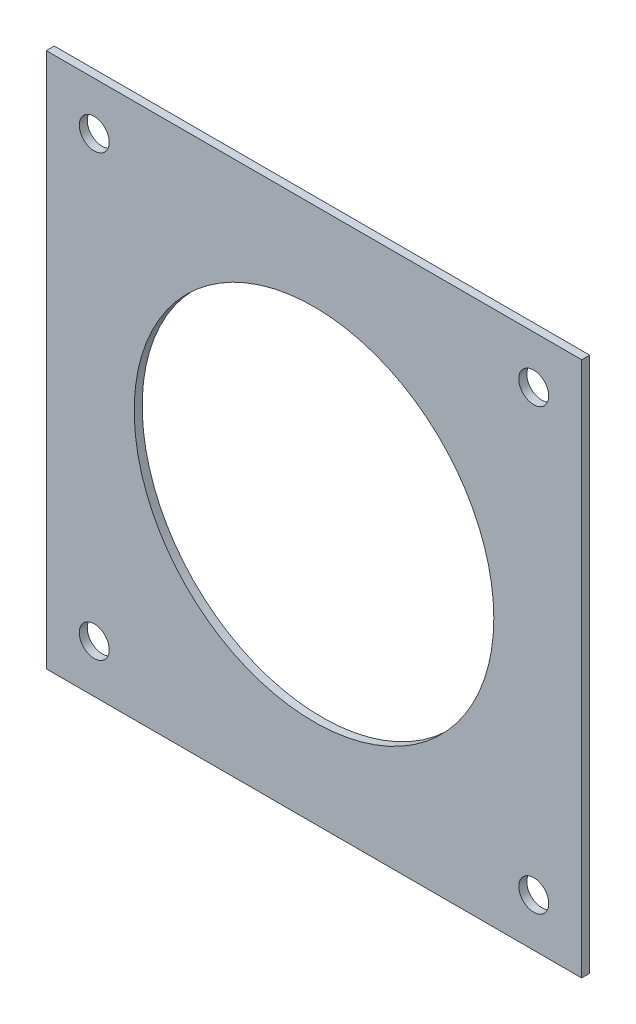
ISO-10303-21;
HEADER;
FILE_DESCRIPTION(('STEP AP214'),'2;1');
FILE_NAME('part.step','',(''),(''),'','','');
FILE_SCHEMA(('AUTOMOTIVE_DESIGN { 1 0 10303 214 1 1 1 1 }'));
ENDSEC;
DATA;
#1=APPLICATION_CONTEXT('core data for automotive mechanical design processes');
#2=APPLICATION_PROTOCOL_DEFINITION('international standard','automotive_design',2000,#1);
#3=PRODUCT_CONTEXT('',#1,'mechanical');
#4=PRODUCT('Part','Part','',(#3));
#5=PRODUCT_RELATED_PRODUCT_CATEGORY('part','',(#4));
#6=PRODUCT_DEFINITION_FORMATION('','',#4);
#7=PRODUCT_DEFINITION_CONTEXT('part definition',#1,'design');
#8=PRODUCT_DEFINITION('design','',#6,#7);
#9=PRODUCT_DEFINITION_SHAPE('','',#8);
#10=(LENGTH_UNIT() NAMED_UNIT(*) SI_UNIT(.MILLI.,.METRE.));
#11=(NAMED_UNIT(*) PLANE_ANGLE_UNIT() SI_UNIT($,.RADIAN.));
#12=(NAMED_UNIT(*) SI_UNIT($,.STERADIAN.) SOLID_ANGLE_UNIT());
#13=UNCERTAINTY_MEASURE_WITH_UNIT(LENGTH_MEASURE(1.E-05),#10,'distance_accuracy_value','');
#14=(GEOMETRIC_REPRESENTATION_CONTEXT(3) GLOBAL_UNCERTAINTY_ASSIGNED_CONTEXT((#13)) GLOBAL_UNIT_ASSIGNED_CONTEXT((#10,
#11,#12)) REPRESENTATION_CONTEXT('',''));
#15=CARTESIAN_POINT('',(0.,0.,0.));
#16=DIRECTION('',(0.,0.,1.));
#17=DIRECTION('',(1.,0.,0.));
#18=AXIS2_PLACEMENT_3D('',#15,#16,#17);
#19=CARTESIAN_POINT('',(-26.8,26.8,0.8));
#20=DIRECTION('',(1.,0.,0.));
#21=DIRECTION('',(0.,1.,0.));
#22=AXIS2_PLACEMENT_3D('',#19,#20,#21);
#23=PLANE('',#22);
#24=DIRECTION('',(0.,-1.,0.));
#25=VECTOR('',#24,1.);
#26=CARTESIAN_POINT('',(-26.8,26.8,0.));
#27=LINE('',#26,#25);
#28=CARTESIAN_POINT('',(-26.8,26.8,0.));
#29=VERTEX_POINT('',#28);
#30=CARTESIAN_POINT('',(-26.8,-26.8,0.));
#31=VERTEX_POINT('',#30);
#32=EDGE_CURVE('E81',#29,#31,#27,.T.);
#33=ORIENTED_EDGE('',*,*,#32,.T.);
#34=DIRECTION('',(0.,0.,-1.));
#35=VECTOR('',#34,1.);
#36=CARTESIAN_POINT('',(-26.8,-26.8,0.8));
#37=LINE('',#36,#35);
#38=CARTESIAN_POINT('',(-26.8,-26.8,0.8));
#39=VERTEX_POINT('',#38);
#40=EDGE_CURVE('E10',#39,#31,#37,.T.);
#41=ORIENTED_EDGE('',*,*,#40,.F.);
#42=DIRECTION('',(0.,-1.,0.));
#43=VECTOR('',#42,1.);
#44=CARTESIAN_POINT('',(-26.8,26.8,0.8));
#45=LINE('',#44,#43);
#46=CARTESIAN_POINT('',(-26.8,26.8,0.8));
#47=VERTEX_POINT('',#46);
#48=EDGE_CURVE('E68',#47,#39,#45,.T.);
#49=ORIENTED_EDGE('',*,*,#48,.F.);
#50=DIRECTION('',(0.,0.,-1.));
#51=VECTOR('',#50,1.);
#52=CARTESIAN_POINT('',(-26.8,26.8,0.8));
#53=LINE('',#52,#51);
#54=EDGE_CURVE('E77',#47,#29,#53,.T.);
#55=ORIENTED_EDGE('',*,*,#54,.T.);
#56=EDGE_LOOP('',(#33,#41,#49,#55));
#57=FACE_BOUND('',#56,.T.);
#58=ADVANCED_FACE('F15',(#57),#23,.F.);
#59=CARTESIAN_POINT('',(-26.8,-26.8,0.8));
#60=DIRECTION('',(0.,1.,0.));
#61=DIRECTION('',(0.,0.,1.));
#62=AXIS2_PLACEMENT_3D('',#59,#60,#61);
#63=PLANE('',#62);
#64=DIRECTION('',(1.,0.,0.));
#65=VECTOR('',#64,1.);
#66=CARTESIAN_POINT('',(-26.8,-26.8,0.));
#67=LINE('',#66,#65);
#68=CARTESIAN_POINT('',(26.8,-26.8,0.));
#69=VERTEX_POINT('',#68);
#70=EDGE_CURVE('E72',#31,#69,#67,.T.);
#71=ORIENTED_EDGE('',*,*,#70,.T.);
#72=DIRECTION('',(0.,0.,-1.));
#73=VECTOR('',#72,1.);
#74=CARTESIAN_POINT('',(26.8,-26.8,0.8));
#75=LINE('',#74,#73);
#76=CARTESIAN_POINT('',(26.8,-26.8,0.8));
#77=VERTEX_POINT('',#76);
#78=EDGE_CURVE('E24',#77,#69,#75,.T.);
#79=ORIENTED_EDGE('',*,*,#78,.F.);
#80=DIRECTION('',(1.,0.,0.));
#81=VECTOR('',#80,1.);
#82=CARTESIAN_POINT('',(-26.8,-26.8,0.8));
#83=LINE('',#82,#81);
#84=EDGE_CURVE('E63',#39,#77,#83,.T.);
#85=ORIENTED_EDGE('',*,*,#84,.F.);
#86=ORIENTED_EDGE('',*,*,#40,.T.);
#87=EDGE_LOOP('',(#71,#79,#85,#86));
#88=FACE_BOUND('',#87,.T.);
#89=ADVANCED_FACE('F71',(#88),#63,.F.);
#90=CARTESIAN_POINT('',(26.8,26.8,0.8));
#91=DIRECTION('',(-1.,0.,0.));
#92=DIRECTION('',(0.,-1.,0.));
#93=AXIS2_PLACEMENT_3D('',#90,#91,#92);
#94=PLANE('',#93);
#95=DIRECTION('',(0.,1.,0.));
#96=VECTOR('',#95,1.);
#97=CARTESIAN_POINT('',(26.8,26.8,0.));
#98=LINE('',#97,#96);
#99=CARTESIAN_POINT('',(26.8,26.8,0.));
#100=VERTEX_POINT('',#99);
#101=EDGE_CURVE('E50',#69,#100,#98,.T.);
#102=ORIENTED_EDGE('',*,*,#101,.T.);
#103=DIRECTION('',(0.,0.,-1.));
#104=VECTOR('',#103,1.);
#105=CARTESIAN_POINT('',(26.8,26.8,0.8));
#106=LINE('',#105,#104);
#107=CARTESIAN_POINT('',(26.8,26.8,0.8));
#108=VERTEX_POINT('',#107);
#109=EDGE_CURVE('E73',#108,#100,#106,.T.);
#110=ORIENTED_EDGE('',*,*,#109,.F.);
#111=DIRECTION('',(0.,1.,0.));
#112=VECTOR('',#111,1.);
#113=CARTESIAN_POINT('',(26.8,26.8,0.8));
#114=LINE('',#113,#112);
#115=EDGE_CURVE('E66',#77,#108,#114,.T.);
#116=ORIENTED_EDGE('',*,*,#115,.F.);
#117=ORIENTED_EDGE('',*,*,#78,.T.);
#118=EDGE_LOOP('',(#102,#110,#116,#117));
#119=FACE_BOUND('',#118,.T.);
#120=ADVANCED_FACE('F75',(#119),#94,.F.);
#121=CARTESIAN_POINT('',(-26.8,26.8,0.8));
#122=DIRECTION('',(0.,-1.,0.));
#123=DIRECTION('',(0.,0.,-1.));
#124=AXIS2_PLACEMENT_3D('',#121,#122,#123);
#125=PLANE('',#124);
#126=DIRECTION('',(-1.,0.,0.));
#127=VECTOR('',#126,1.);
#128=CARTESIAN_POINT('',(-26.8,26.8,0.));
#129=LINE('',#128,#127);
#130=EDGE_CURVE('E56',#100,#29,#129,.T.);
#131=ORIENTED_EDGE('',*,*,#130,.T.);
#132=ORIENTED_EDGE('',*,*,#54,.F.);
#133=DIRECTION('',(-1.,0.,0.));
#134=VECTOR('',#133,1.);
#135=CARTESIAN_POINT('',(-26.8,26.8,0.8));
#136=LINE('',#135,#134);
#137=EDGE_CURVE('E33',#108,#47,#136,.T.);
#138=ORIENTED_EDGE('',*,*,#137,.F.);
#139=ORIENTED_EDGE('',*,*,#109,.T.);
#140=EDGE_LOOP('',(#131,#132,#138,#139));
#141=FACE_BOUND('',#140,.T.);
#142=ADVANCED_FACE('F120',(#141),#125,.F.);
#143=CARTESIAN_POINT('',(-26.8,-26.8,0.8));
#144=DIRECTION('',(0.,0.,1.));
#145=DIRECTION('',(1.,0.,0.));
#146=AXIS2_PLACEMENT_3D('',#143,#144,#145);
#147=PLANE('',#146);
#148=CARTESIAN_POINT('',(0.,0.,0.8));
#149=DIRECTION('',(0.,0.,1.));
#150=DIRECTION('',(1.,0.,0.));
#151=AXIS2_PLACEMENT_3D('',#148,#149,#150);
#152=CIRCLE('',#151,18.);
#153=CARTESIAN_POINT('',(18.,0.,0.8));
#154=VERTEX_POINT('',#153);
#155=EDGE_CURVE('E338',#154,#154,#152,.T.);
#156=ORIENTED_EDGE('',*,*,#155,.F.);
#157=EDGE_LOOP('',(#156));
#158=FACE_BOUND('',#157,.T.);
#159=CARTESIAN_POINT('',(-22.,-22.,0.8));
#160=DIRECTION('',(0.,0.,1.));
#161=DIRECTION('',(-1.,0.,0.));
#162=AXIS2_PLACEMENT_3D('',#159,#160,#161);
#163=CIRCLE('',#162,1.5);
#164=CARTESIAN_POINT('',(-23.5,-22.,0.8));
#165=VERTEX_POINT('',#164);
#166=EDGE_CURVE('E108',#165,#165,#163,.T.);
#167=ORIENTED_EDGE('',*,*,#166,.F.);
#168=EDGE_LOOP('',(#167));
#169=FACE_BOUND('',#168,.T.);
#170=CARTESIAN_POINT('',(22.,-22.,0.8));
#171=DIRECTION('',(0.,0.,1.));
#172=DIRECTION('',(1.,0.,0.));
#173=AXIS2_PLACEMENT_3D('',#170,#171,#172);
#174=CIRCLE('',#173,1.5);
#175=CARTESIAN_POINT('',(23.5,-22.,0.8));
#176=VERTEX_POINT('',#175);
#177=EDGE_CURVE('E98',#176,#176,#174,.T.);
#178=ORIENTED_EDGE('',*,*,#177,.F.);
#179=EDGE_LOOP('',(#178));
#180=FACE_BOUND('',#179,.T.);
#181=CARTESIAN_POINT('',(22.,22.,0.8));
#182=DIRECTION('',(0.,0.,1.));
#183=DIRECTION('',(-1.,0.,0.));
#184=AXIS2_PLACEMENT_3D('',#181,#182,#183);
#185=CIRCLE('',#184,1.5);
#186=CARTESIAN_POINT('',(20.5,22.,0.8));
#187=VERTEX_POINT('',#186);
#188=EDGE_CURVE('E95',#187,#187,#185,.T.);
#189=ORIENTED_EDGE('',*,*,#188,.F.);
#190=EDGE_LOOP('',(#189));
#191=FACE_BOUND('',#190,.T.);
#192=CARTESIAN_POINT('',(-22.,22.,0.8));
#193=DIRECTION('',(0.,0.,1.));
#194=DIRECTION('',(1.,0.,0.));
#195=AXIS2_PLACEMENT_3D('',#192,#193,#194);
#196=CIRCLE('',#195,1.5);
#197=CARTESIAN_POINT('',(-20.5,22.,0.8));
#198=VERTEX_POINT('',#197);
#199=EDGE_CURVE('E92',#198,#198,#196,.T.);
#200=ORIENTED_EDGE('',*,*,#199,.F.);
#201=EDGE_LOOP('',(#200));
#202=FACE_BOUND('',#201,.T.);
#203=ORIENTED_EDGE('',*,*,#48,.T.);
#204=ORIENTED_EDGE('',*,*,#84,.T.);
#205=ORIENTED_EDGE('',*,*,#115,.T.);
#206=ORIENTED_EDGE('',*,*,#137,.T.);
#207=EDGE_LOOP('',(#203,#204,#205,#206));
#208=FACE_BOUND('',#207,.T.);
#209=ADVANCED_FACE('F64',(#158,#169,#180,#191,#202,#208),#147,.T.);
#210=CARTESIAN_POINT('',(-26.8,-26.8,0.));
#211=DIRECTION('',(0.,0.,1.));
#212=DIRECTION('',(1.,0.,0.));
#213=AXIS2_PLACEMENT_3D('',#210,#211,#212);
#214=PLANE('',#213);
#215=CARTESIAN_POINT('',(0.,0.,0.));
#216=DIRECTION('',(0.,0.,1.));
#217=DIRECTION('',(1.,0.,0.));
#218=AXIS2_PLACEMENT_3D('',#215,#216,#217);
#219=CIRCLE('',#218,18.);
#220=CARTESIAN_POINT('',(18.,0.,0.));
#221=VERTEX_POINT('',#220);
#222=EDGE_CURVE('E341',#221,#221,#219,.F.);
#223=ORIENTED_EDGE('',*,*,#222,.F.);
#224=EDGE_LOOP('',(#223));
#225=FACE_BOUND('',#224,.T.);
#226=CARTESIAN_POINT('',(-22.,-22.,0.));
#227=DIRECTION('',(0.,0.,1.));
#228=DIRECTION('',(1.,0.,0.));
#229=AXIS2_PLACEMENT_3D('',#226,#227,#228);
#230=CIRCLE('',#229,1.5);
#231=CARTESIAN_POINT('',(-20.5,-22.,0.));
#232=VERTEX_POINT('',#231);
#233=EDGE_CURVE('E18',#232,#232,#230,.T.);
#234=ORIENTED_EDGE('',*,*,#233,.T.);
#235=EDGE_LOOP('',(#234));
#236=FACE_BOUND('',#235,.T.);
#237=CARTESIAN_POINT('',(22.,-22.,0.));
#238=DIRECTION('',(0.,0.,1.));
#239=DIRECTION('',(1.,0.,0.));
#240=AXIS2_PLACEMENT_3D('',#237,#238,#239);
#241=CIRCLE('',#240,1.5);
#242=CARTESIAN_POINT('',(23.5,-22.,0.));
#243=VERTEX_POINT('',#242);
#244=EDGE_CURVE('E96',#243,#243,#241,.T.);
#245=ORIENTED_EDGE('',*,*,#244,.T.);
#246=EDGE_LOOP('',(#245));
#247=FACE_BOUND('',#246,.T.);
#248=CARTESIAN_POINT('',(22.,22.,0.));
#249=DIRECTION('',(0.,0.,1.));
#250=DIRECTION('',(1.,0.,0.));
#251=AXIS2_PLACEMENT_3D('',#248,#249,#250);
#252=CIRCLE('',#251,1.5);
#253=CARTESIAN_POINT('',(23.5,22.,0.));
#254=VERTEX_POINT('',#253);
#255=EDGE_CURVE('E93',#254,#254,#252,.T.);
#256=ORIENTED_EDGE('',*,*,#255,.T.);
#257=EDGE_LOOP('',(#256));
#258=FACE_BOUND('',#257,.T.);
#259=CARTESIAN_POINT('',(-22.,22.,0.));
#260=DIRECTION('',(0.,0.,1.));
#261=DIRECTION('',(1.,0.,0.));
#262=AXIS2_PLACEMENT_3D('',#259,#260,#261);
#263=CIRCLE('',#262,1.5);
#264=CARTESIAN_POINT('',(-20.5,22.,0.));
#265=VERTEX_POINT('',#264);
#266=EDGE_CURVE('E84',#265,#265,#263,.T.);
#267=ORIENTED_EDGE('',*,*,#266,.T.);
#268=EDGE_LOOP('',(#267));
#269=FACE_BOUND('',#268,.T.);
#270=ORIENTED_EDGE('',*,*,#32,.F.);
#271=ORIENTED_EDGE('',*,*,#130,.F.);
#272=ORIENTED_EDGE('',*,*,#101,.F.);
#273=ORIENTED_EDGE('',*,*,#70,.F.);
#274=EDGE_LOOP('',(#270,#271,#272,#273));
#275=FACE_BOUND('',#274,.T.);
#276=ADVANCED_FACE('F119',(#225,#236,#247,#258,#269,#275),#214,.F.);
#277=CARTESIAN_POINT('',(-22.,22.,-1.2));
#278=DIRECTION('',(0.,0.,1.));
#279=DIRECTION('',(1.,0.,0.));
#280=AXIS2_PLACEMENT_3D('',#277,#278,#279);
#281=CYLINDRICAL_SURFACE('',#280,1.5);
#282=ORIENTED_EDGE('',*,*,#199,.T.);
#283=EDGE_LOOP('',(#282));
#284=FACE_BOUND('',#283,.T.);
#285=ORIENTED_EDGE('',*,*,#266,.F.);
#286=EDGE_LOOP('',(#285));
#287=FACE_BOUND('',#286,.T.);
#288=ADVANCED_FACE('F115',(#284,#287),#281,.F.);
#289=CARTESIAN_POINT('',(22.,22.,-1.2));
#290=DIRECTION('',(0.,0.,1.));
#291=DIRECTION('',(1.,0.,0.));
#292=AXIS2_PLACEMENT_3D('',#289,#290,#291);
#293=CYLINDRICAL_SURFACE('',#292,1.5);
#294=ORIENTED_EDGE('',*,*,#188,.T.);
#295=EDGE_LOOP('',(#294));
#296=FACE_BOUND('',#295,.T.);
#297=ORIENTED_EDGE('',*,*,#255,.F.);
#298=EDGE_LOOP('',(#297));
#299=FACE_BOUND('',#298,.T.);
#300=ADVANCED_FACE('F187',(#296,#299),#293,.F.);
#301=CARTESIAN_POINT('',(22.,-22.,-1.2));
#302=DIRECTION('',(0.,0.,1.));
#303=DIRECTION('',(1.,0.,0.));
#304=AXIS2_PLACEMENT_3D('',#301,#302,#303);
#305=CYLINDRICAL_SURFACE('',#304,1.5);
#306=ORIENTED_EDGE('',*,*,#177,.T.);
#307=EDGE_LOOP('',(#306));
#308=FACE_BOUND('',#307,.T.);
#309=ORIENTED_EDGE('',*,*,#244,.F.);
#310=EDGE_LOOP('',(#309));
#311=FACE_BOUND('',#310,.T.);
#312=ADVANCED_FACE('F198',(#308,#311),#305,.F.);
#313=CARTESIAN_POINT('',(-22.,-22.,-1.2));
#314=DIRECTION('',(0.,0.,1.));
#315=DIRECTION('',(1.,0.,0.));
#316=AXIS2_PLACEMENT_3D('',#313,#314,#315);
#317=CYLINDRICAL_SURFACE('',#316,1.5);
#318=ORIENTED_EDGE('',*,*,#166,.T.);
#319=EDGE_LOOP('',(#318));
#320=FACE_BOUND('',#319,.T.);
#321=ORIENTED_EDGE('',*,*,#233,.F.);
#322=EDGE_LOOP('',(#321));
#323=FACE_BOUND('',#322,.T.);
#324=ADVANCED_FACE('F211',(#320,#323),#317,.F.);
#325=CARTESIAN_POINT('',(0.,0.,-0.00100000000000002));
#326=DIRECTION('',(0.,0.,1.));
#327=DIRECTION('',(1.,0.,0.));
#328=AXIS2_PLACEMENT_3D('',#325,#326,#327);
#329=CYLINDRICAL_SURFACE('',#328,18.);
#330=CARTESIAN_POINT('',(18.,0.,0.8));
#331=CARTESIAN_POINT('',(18.,0.,0.791666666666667));
#332=CARTESIAN_POINT('',(18.,0.,0.783333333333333));
#333=CARTESIAN_POINT('',(18.,0.,0.766666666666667));
#334=CARTESIAN_POINT('',(18.,0.,0.758333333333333));
#335=CARTESIAN_POINT('',(18.,0.,0.741666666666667));
#336=CARTESIAN_POINT('',(18.,0.,0.733333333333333));
#337=CARTESIAN_POINT('',(18.,0.,0.716666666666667));
#338=CARTESIAN_POINT('',(18.,0.,0.708333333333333));
#339=CARTESIAN_POINT('',(18.,0.,0.691666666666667));
#340=CARTESIAN_POINT('',(18.,0.,0.683333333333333));
#341=CARTESIAN_POINT('',(18.,0.,0.666666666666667));
#342=CARTESIAN_POINT('',(18.,0.,0.658333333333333));
#343=CARTESIAN_POINT('',(18.,0.,0.641666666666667));
#344=CARTESIAN_POINT('',(18.,0.,0.633333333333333));
#345=CARTESIAN_POINT('',(18.,0.,0.616666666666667));
#346=CARTESIAN_POINT('',(18.,0.,0.608333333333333));
#347=CARTESIAN_POINT('',(18.,0.,0.591666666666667));
#348=CARTESIAN_POINT('',(18.,0.,0.583333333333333));
#349=CARTESIAN_POINT('',(18.,0.,0.566666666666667));
#350=CARTESIAN_POINT('',(18.,0.,0.558333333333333));
#351=CARTESIAN_POINT('',(18.,0.,0.541666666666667));
#352=CARTESIAN_POINT('',(18.,0.,0.533333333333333));
#353=CARTESIAN_POINT('',(18.,0.,0.516666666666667));
#354=CARTESIAN_POINT('',(18.,0.,0.508333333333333));
#355=CARTESIAN_POINT('',(18.,0.,0.491666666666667));
#356=CARTESIAN_POINT('',(18.,0.,0.483333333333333));
#357=CARTESIAN_POINT('',(18.,0.,0.466666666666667));
#358=CARTESIAN_POINT('',(18.,0.,0.458333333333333));
#359=CARTESIAN_POINT('',(18.,0.,0.441666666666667));
#360=CARTESIAN_POINT('',(18.,0.,0.433333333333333));
#361=CARTESIAN_POINT('',(18.,0.,0.416666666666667));
#362=CARTESIAN_POINT('',(18.,0.,0.408333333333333));
#363=CARTESIAN_POINT('',(18.,0.,0.391666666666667));
#364=CARTESIAN_POINT('',(18.,0.,0.383333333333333));
#365=CARTESIAN_POINT('',(18.,0.,0.366666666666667));
#366=CARTESIAN_POINT('',(18.,0.,0.358333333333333));
#367=CARTESIAN_POINT('',(18.,0.,0.341666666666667));
#368=CARTESIAN_POINT('',(18.,0.,0.333333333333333));
#369=CARTESIAN_POINT('',(18.,0.,0.316666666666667));
#370=CARTESIAN_POINT('',(18.,0.,0.308333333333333));
#371=CARTESIAN_POINT('',(18.,0.,0.291666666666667));
#372=CARTESIAN_POINT('',(18.,0.,0.283333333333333));
#373=CARTESIAN_POINT('',(18.,0.,0.266666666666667));
#374=CARTESIAN_POINT('',(18.,0.,0.258333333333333));
#375=CARTESIAN_POINT('',(18.,0.,0.241666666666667));
#376=CARTESIAN_POINT('',(18.,0.,0.233333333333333));
#377=CARTESIAN_POINT('',(18.,0.,0.216666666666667));
#378=CARTESIAN_POINT('',(18.,0.,0.208333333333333));
#379=CARTESIAN_POINT('',(18.,0.,0.191666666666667));
#380=CARTESIAN_POINT('',(18.,0.,0.183333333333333));
#381=CARTESIAN_POINT('',(18.,0.,0.166666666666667));
#382=CARTESIAN_POINT('',(18.,0.,0.158333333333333));
#383=CARTESIAN_POINT('',(18.,0.,0.141666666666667));
#384=CARTESIAN_POINT('',(18.,0.,0.133333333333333));
#385=CARTESIAN_POINT('',(18.,0.,0.116666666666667));
#386=CARTESIAN_POINT('',(18.,0.,0.108333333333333));
#387=CARTESIAN_POINT('',(18.,0.,0.0916666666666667));
#388=CARTESIAN_POINT('',(18.,0.,0.0833333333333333));
#389=CARTESIAN_POINT('',(18.,0.,0.0666666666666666));
#390=CARTESIAN_POINT('',(18.,0.,0.0583333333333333));
#391=CARTESIAN_POINT('',(18.,0.,0.0416666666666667));
#392=CARTESIAN_POINT('',(18.,0.,0.0333333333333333));
#393=CARTESIAN_POINT('',(18.,0.,0.0166666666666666));
#394=CARTESIAN_POINT('',(18.,0.,0.00833333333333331));
#395=CARTESIAN_POINT('',(18.,0.,0.));
#396=B_SPLINE_CURVE_WITH_KNOTS('',3,(#330,#331,#332,#333,#334,#335,#336,#337,#338,#339,#340,
#341,#342,#343,#344,#345,#346,#347,#348,#349,#350,#351,#352,#353,#354,#355,#356,#357,#358,#359,
#360,#361,#362,#363,#364,#365,#366,#367,#368,#369,#370,#371,#372,#373,#374,#375,#376,#377,#378,
#379,#380,#381,#382,#383,#384,#385,#386,#387,#388,#389,#390,#391,#392,#393,#394,#395),
.UNSPECIFIED.,.F.,.F.,(4,2,2,2,2,2,2,2,2,2,2,2,2,2,2,2,2,2,2,2,2,2,2,2,2,2,2,2,2,2,2,2,4),(0.,
0.025,0.05,0.075,0.1,0.125,0.15,0.175,0.2,0.225,0.25,0.275,0.3,0.325,0.35,0.375,0.4,0.425,0.45,
0.475,0.5,0.525,0.55,0.575,0.6,0.625,0.65,0.675,0.7,0.725,0.75,0.775,0.8),.UNSPECIFIED.);
#397=EDGE_CURVE('BSEAM222',#154,#221,#396,.T.);
#398=ORIENTED_EDGE('',*,*,#155,.T.);
#399=ORIENTED_EDGE('',*,*,#222,.T.);
#400=ORIENTED_EDGE('',*,*,#397,.T.);
#401=ORIENTED_EDGE('',*,*,#397,.F.);
#402=EDGE_LOOP('',(#398,#400,#399,#401));
#403=FACE_BOUND('',#402,.T.);
#404=ADVANCED_FACE('F222',(#403),#329,.F.);
#405=CLOSED_SHELL('',(#58,#89,#120,#142,#209,#276,#288,#300,#312,#324,#404));
#406=MANIFOLD_SOLID_BREP('B1',#405);
#407=ADVANCED_BREP_SHAPE_REPRESENTATION('',(#18,#406),#14);
#408=SHAPE_DEFINITION_REPRESENTATION(#9,#407);
ENDSEC;
END-ISO-10303-21;
